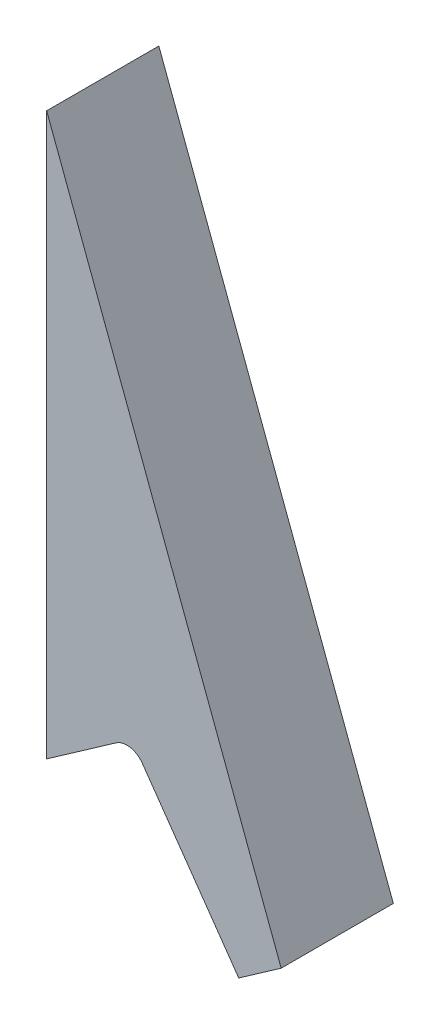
ISO-10303-21;
HEADER;
FILE_DESCRIPTION(('STEP AP214'),'2;1');
FILE_NAME('part.step','',(''),(''),'','','');
FILE_SCHEMA(('AUTOMOTIVE_DESIGN { 1 0 10303 214 1 1 1 1 }'));
ENDSEC;
DATA;
#1=APPLICATION_CONTEXT('core data for automotive mechanical design processes');
#2=APPLICATION_PROTOCOL_DEFINITION('international standard','automotive_design',2000,#1);
#3=PRODUCT_CONTEXT('',#1,'mechanical');
#4=PRODUCT('Part','Part','',(#3));
#5=PRODUCT_RELATED_PRODUCT_CATEGORY('part','',(#4));
#6=PRODUCT_DEFINITION_FORMATION('','',#4);
#7=PRODUCT_DEFINITION_CONTEXT('part definition',#1,'design');
#8=PRODUCT_DEFINITION('design','',#6,#7);
#9=PRODUCT_DEFINITION_SHAPE('','',#8);
#10=(LENGTH_UNIT() NAMED_UNIT(*) SI_UNIT(.MILLI.,.METRE.));
#11=(NAMED_UNIT(*) PLANE_ANGLE_UNIT() SI_UNIT($,.RADIAN.));
#12=(NAMED_UNIT(*) SI_UNIT($,.STERADIAN.) SOLID_ANGLE_UNIT());
#13=UNCERTAINTY_MEASURE_WITH_UNIT(LENGTH_MEASURE(1.E-05),#10,'distance_accuracy_value','');
#14=(GEOMETRIC_REPRESENTATION_CONTEXT(3) GLOBAL_UNCERTAINTY_ASSIGNED_CONTEXT((#13)) GLOBAL_UNIT_ASSIGNED_CONTEXT((#10,
#11,#12)) REPRESENTATION_CONTEXT('',''));
#15=CARTESIAN_POINT('',(0.,0.,0.));
#16=DIRECTION('',(0.,0.,1.));
#17=DIRECTION('',(1.,0.,0.));
#18=AXIS2_PLACEMENT_3D('',#15,#16,#17);
#19=CARTESIAN_POINT('',(8.860009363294,33.860009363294,12.));
#20=DIRECTION('',(0.,0.,1.));
#21=DIRECTION('',(1.,0.,0.));
#22=AXIS2_PLACEMENT_3D('',#19,#20,#21);
#23=PLANE('',#22);
#24=DIRECTION('',(-0.351123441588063,0.936329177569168,0.));
#25=VECTOR('',#24,1.);
#26=CARTESIAN_POINT('',(30.,0.,12.));
#27=LINE('',#26,#25);
#28=CARTESIAN_POINT('',(25.090633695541,13.091643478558,12.));
#29=VERTEX_POINT('',#28);
#30=CARTESIAN_POINT('',(0.,80.,12.));
#31=VERTEX_POINT('',#30);
#32=EDGE_CURVE('E99',#29,#31,#27,.T.);
#33=ORIENTED_EDGE('',*,*,#32,.T.);
#34=DIRECTION('',(0.,-1.,0.));
#35=VECTOR('',#34,1.);
#36=CARTESIAN_POINT('',(0.,80.,12.));
#37=LINE('',#36,#35);
#38=CARTESIAN_POINT('',(0.,19.941311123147,12.));
#39=VERTEX_POINT('',#38);
#40=EDGE_CURVE('E10',#31,#39,#37,.T.);
#41=ORIENTED_EDGE('',*,*,#40,.T.);
#42=DIRECTION('',(-0.819231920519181,-0.573462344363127,0.));
#43=VECTOR('',#42,1.);
#44=CARTESIAN_POINT('',(-12.56543540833,11.145506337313,12.));
#45=LINE('',#44,#43);
#46=CARTESIAN_POINT('',(7.441584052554,25.150419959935,12.));
#47=VERTEX_POINT('',#46);
#48=EDGE_CURVE('E26',#47,#39,#45,.T.);
#49=ORIENTED_EDGE('',*,*,#48,.F.);
#50=CARTESIAN_POINT('',(8.588508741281,23.511956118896,12.));
#51=DIRECTION('',(0.,0.,-1.));
#52=DIRECTION('',(0.573462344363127,-0.819231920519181,0.));
#53=AXIS2_PLACEMENT_3D('',#50,#51,#52);
#54=CIRCLE('',#53,2.);
#55=CARTESIAN_POINT('',(10.226972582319,24.658880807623,12.));
#56=VERTEX_POINT('',#55);
#57=EDGE_CURVE('E62',#47,#56,#54,.T.);
#58=ORIENTED_EDGE('',*,*,#57,.T.);
#59=DIRECTION('',(0.573462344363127,-0.819231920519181,0.));
#60=VECTOR('',#59,1.);
#61=CARTESIAN_POINT('',(13.575487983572,19.875287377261,12.));
#62=LINE('',#61,#60);
#63=CARTESIAN_POINT('',(20.549294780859,9.91270623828,12.));
#64=VERTEX_POINT('',#63);
#65=EDGE_CURVE('E67',#56,#64,#62,.T.);
#66=ORIENTED_EDGE('',*,*,#65,.T.);
#67=DIRECTION('',(-0.819231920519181,-0.573462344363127,0.));
#68=VECTOR('',#67,1.);
#69=CARTESIAN_POINT('',(13.027696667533,4.647587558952,12.));
#70=LINE('',#69,#68);
#71=EDGE_CURVE('E70',#29,#64,#70,.T.);
#72=ORIENTED_EDGE('',*,*,#71,.F.);
#73=EDGE_LOOP('',(#33,#41,#49,#58,#66,#72));
#74=FACE_BOUND('',#73,.T.);
#75=ADVANCED_FACE('F16',(#74),#23,.T.);
#76=CARTESIAN_POINT('',(0.,80.,0.));
#77=DIRECTION('',(1.,0.,0.));
#78=DIRECTION('',(0.,1.,0.));
#79=AXIS2_PLACEMENT_3D('',#76,#77,#78);
#80=PLANE('',#79);
#81=DIRECTION('',(0.,0.,1.));
#82=VECTOR('',#81,1.);
#83=CARTESIAN_POINT('',(0.,19.941311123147,3.));
#84=LINE('',#83,#82);
#85=CARTESIAN_POINT('',(0.,19.941311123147,0.));
#86=VERTEX_POINT('',#85);
#87=EDGE_CURVE('E125',#86,#39,#84,.T.);
#88=ORIENTED_EDGE('',*,*,#87,.T.);
#89=ORIENTED_EDGE('',*,*,#40,.F.);
#90=DIRECTION('',(0.,0.,1.));
#91=VECTOR('',#90,1.);
#92=CARTESIAN_POINT('',(0.,80.,0.));
#93=LINE('',#92,#91);
#94=CARTESIAN_POINT('',(0.,80.,0.));
#95=VERTEX_POINT('',#94);
#96=EDGE_CURVE('E113',#95,#31,#93,.T.);
#97=ORIENTED_EDGE('',*,*,#96,.F.);
#98=DIRECTION('',(0.,-1.,0.));
#99=VECTOR('',#98,1.);
#100=CARTESIAN_POINT('',(0.,80.,0.));
#101=LINE('',#100,#99);
#102=EDGE_CURVE('E108',#95,#86,#101,.T.);
#103=ORIENTED_EDGE('',*,*,#102,.T.);
#104=EDGE_LOOP('',(#88,#89,#97,#103));
#105=FACE_BOUND('',#104,.T.);
#106=ADVANCED_FACE('F18',(#105),#80,.F.);
#107=CARTESIAN_POINT('',(-37.61617157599,-6.390008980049,6.));
#108=DIRECTION('',(-0.573462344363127,0.819231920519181,0.));
#109=DIRECTION('',(0.,0.,1.));
#110=AXIS2_PLACEMENT_3D('',#107,#108,#109);
#111=PLANE('',#110);
#112=ORIENTED_EDGE('',*,*,#87,.F.);
#113=DIRECTION('',(-0.819231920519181,-0.573462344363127,0.));
#114=VECTOR('',#113,1.);
#115=CARTESIAN_POINT('',(-12.56543540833,11.145506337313,0.));
#116=LINE('',#115,#114);
#117=CARTESIAN_POINT('',(7.441584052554,25.150419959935,0.));
#118=VERTEX_POINT('',#117);
#119=EDGE_CURVE('E105',#118,#86,#116,.T.);
#120=ORIENTED_EDGE('',*,*,#119,.F.);
#121=DIRECTION('',(0.,0.,-1.));
#122=VECTOR('',#121,1.);
#123=CARTESIAN_POINT('',(7.441584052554,25.150419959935,61.));
#124=LINE('',#123,#122);
#125=EDGE_CURVE('E121',#47,#118,#124,.T.);
#126=ORIENTED_EDGE('',*,*,#125,.F.);
#127=ORIENTED_EDGE('',*,*,#48,.T.);
#128=EDGE_LOOP('',(#112,#120,#126,#127));
#129=FACE_BOUND('',#128,.T.);
#130=ADVANCED_FACE('F135',(#129),#111,.F.);
#131=CARTESIAN_POINT('',(8.588508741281,23.511956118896,61.));
#132=DIRECTION('',(0.,0.,-1.));
#133=DIRECTION('',(0.573462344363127,-0.819231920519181,0.));
#134=AXIS2_PLACEMENT_3D('',#131,#132,#133);
#135=CYLINDRICAL_SURFACE('',#134,2.);
#136=DIRECTION('',(0.,0.,-1.));
#137=VECTOR('',#136,1.);
#138=CARTESIAN_POINT('',(10.226972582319,24.658880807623,61.));
#139=LINE('',#138,#137);
#140=CARTESIAN_POINT('',(10.226972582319,24.658880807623,0.));
#141=VERTEX_POINT('',#140);
#142=EDGE_CURVE('E75',#56,#141,#139,.T.);
#143=ORIENTED_EDGE('',*,*,#142,.F.);
#144=ORIENTED_EDGE('',*,*,#57,.F.);
#145=ORIENTED_EDGE('',*,*,#125,.T.);
#146=CARTESIAN_POINT('',(8.588508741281,23.511956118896,0.));
#147=DIRECTION('',(0.,0.,-1.));
#148=DIRECTION('',(0.573462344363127,-0.819231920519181,0.));
#149=AXIS2_PLACEMENT_3D('',#146,#147,#148);
#150=CIRCLE('',#149,2.);
#151=EDGE_CURVE('E103',#118,#141,#150,.T.);
#152=ORIENTED_EDGE('',*,*,#151,.T.);
#153=EDGE_LOOP('',(#143,#144,#145,#152));
#154=FACE_BOUND('',#153,.T.);
#155=ADVANCED_FACE('F169',(#154),#135,.F.);
#156=CARTESIAN_POINT('',(21.696219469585,8.274242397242,61.));
#157=DIRECTION('',(-0.819231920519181,-0.573462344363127,0.));
#158=DIRECTION('',(-0.573462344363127,0.819231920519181,0.));
#159=AXIS2_PLACEMENT_3D('',#156,#157,#158);
#160=PLANE('',#159);
#161=ORIENTED_EDGE('',*,*,#65,.F.);
#162=ORIENTED_EDGE('',*,*,#142,.T.);
#163=DIRECTION('',(0.573462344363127,-0.819231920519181,0.));
#164=VECTOR('',#163,1.);
#165=CARTESIAN_POINT('',(13.575487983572,19.875287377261,0.));
#166=LINE('',#165,#164);
#167=CARTESIAN_POINT('',(20.549294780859,9.91270623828,0.));
#168=VERTEX_POINT('',#167);
#169=EDGE_CURVE('E83',#141,#168,#166,.T.);
#170=ORIENTED_EDGE('',*,*,#169,.T.);
#171=DIRECTION('',(0.,0.,1.));
#172=VECTOR('',#171,1.);
#173=CARTESIAN_POINT('',(20.549294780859,9.91270623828,30.5));
#174=LINE('',#173,#172);
#175=EDGE_CURVE('E76',#168,#64,#174,.T.);
#176=ORIENTED_EDGE('',*,*,#175,.T.);
#177=EDGE_LOOP('',(#161,#162,#170,#176));
#178=FACE_BOUND('',#177,.T.);
#179=ADVANCED_FACE('F80',(#178),#160,.T.);
#180=CARTESIAN_POINT('',(2.100845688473,-3.00120812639,0.));
#181=DIRECTION('',(-0.573462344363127,0.819231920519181,0.));
#182=DIRECTION('',(0.,0.,1.));
#183=AXIS2_PLACEMENT_3D('',#180,#181,#182);
#184=PLANE('',#183);
#185=ORIENTED_EDGE('',*,*,#71,.T.);
#186=ORIENTED_EDGE('',*,*,#175,.F.);
#187=DIRECTION('',(-0.819231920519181,-0.573462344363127,0.));
#188=VECTOR('',#187,1.);
#189=CARTESIAN_POINT('',(13.027696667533,4.647587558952,0.));
#190=LINE('',#189,#188);
#191=CARTESIAN_POINT('',(25.090633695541,13.091643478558,0.));
#192=VERTEX_POINT('',#191);
#193=EDGE_CURVE('E162',#192,#168,#190,.T.);
#194=ORIENTED_EDGE('',*,*,#193,.F.);
#195=DIRECTION('',(0.,0.,-1.));
#196=VECTOR('',#195,1.);
#197=CARTESIAN_POINT('',(25.090633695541,13.091643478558,0.));
#198=LINE('',#197,#196);
#199=EDGE_CURVE('E91',#29,#192,#198,.T.);
#200=ORIENTED_EDGE('',*,*,#199,.F.);
#201=EDGE_LOOP('',(#185,#186,#194,#200));
#202=FACE_BOUND('',#201,.T.);
#203=ADVANCED_FACE('F89',(#202),#184,.F.);
#204=CARTESIAN_POINT('',(30.,0.,0.));
#205=DIRECTION('',(-0.936329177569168,-0.351123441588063,0.));
#206=DIRECTION('',(-0.351123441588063,0.936329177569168,0.));
#207=AXIS2_PLACEMENT_3D('',#204,#205,#206);
#208=PLANE('',#207);
#209=ORIENTED_EDGE('',*,*,#96,.T.);
#210=ORIENTED_EDGE('',*,*,#32,.F.);
#211=ORIENTED_EDGE('',*,*,#199,.T.);
#212=DIRECTION('',(-0.351123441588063,0.936329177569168,0.));
#213=VECTOR('',#212,1.);
#214=CARTESIAN_POINT('',(30.,0.,0.));
#215=LINE('',#214,#213);
#216=EDGE_CURVE('E109',#192,#95,#215,.T.);
#217=ORIENTED_EDGE('',*,*,#216,.T.);
#218=EDGE_LOOP('',(#209,#210,#211,#217));
#219=FACE_BOUND('',#218,.T.);
#220=ADVANCED_FACE('F161',(#219),#208,.F.);
#221=CARTESIAN_POINT('',(8.860009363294,33.860009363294,0.));
#222=DIRECTION('',(0.,0.,1.));
#223=DIRECTION('',(1.,0.,0.));
#224=AXIS2_PLACEMENT_3D('',#221,#222,#223);
#225=PLANE('',#224);
#226=ORIENTED_EDGE('',*,*,#193,.T.);
#227=ORIENTED_EDGE('',*,*,#169,.F.);
#228=ORIENTED_EDGE('',*,*,#151,.F.);
#229=ORIENTED_EDGE('',*,*,#119,.T.);
#230=ORIENTED_EDGE('',*,*,#102,.F.);
#231=ORIENTED_EDGE('',*,*,#216,.F.);
#232=EDGE_LOOP('',(#226,#227,#228,#229,#230,#231));
#233=FACE_BOUND('',#232,.T.);
#234=ADVANCED_FACE('F147',(#233),#225,.F.);
#235=CLOSED_SHELL('',(#75,#106,#130,#155,#179,#203,#220,#234));
#236=MANIFOLD_SOLID_BREP('B1',#235);
#237=ADVANCED_BREP_SHAPE_REPRESENTATION('',(#18,#236),#14);
#238=SHAPE_DEFINITION_REPRESENTATION(#9,#237);
ENDSEC;
END-ISO-10303-21;
